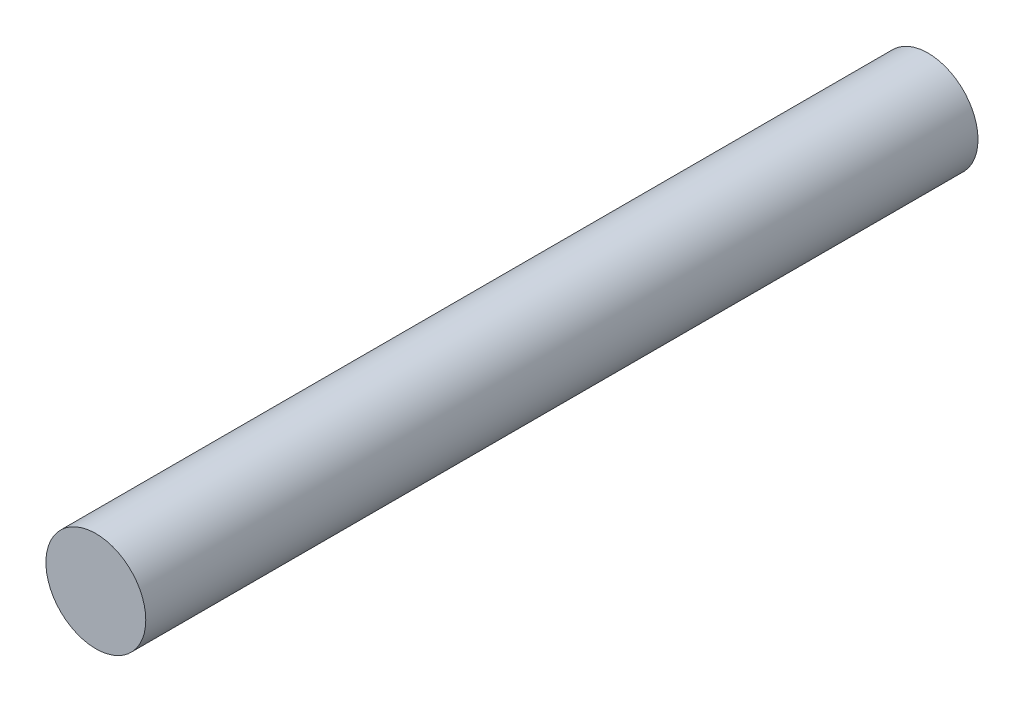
ISO-10303-21;
HEADER;
FILE_DESCRIPTION(('STEP AP214'),'2;1');
FILE_NAME('part.step','',(''),(''),'','','');
FILE_SCHEMA(('AUTOMOTIVE_DESIGN { 1 0 10303 214 1 1 1 1 }'));
ENDSEC;
DATA;
#1=APPLICATION_CONTEXT('core data for automotive mechanical design processes');
#2=APPLICATION_PROTOCOL_DEFINITION('international standard','automotive_design',2000,#1);
#3=PRODUCT_CONTEXT('',#1,'mechanical');
#4=PRODUCT('Part','Part','',(#3));
#5=PRODUCT_RELATED_PRODUCT_CATEGORY('part','',(#4));
#6=PRODUCT_DEFINITION_FORMATION('','',#4);
#7=PRODUCT_DEFINITION_CONTEXT('part definition',#1,'design');
#8=PRODUCT_DEFINITION('design','',#6,#7);
#9=PRODUCT_DEFINITION_SHAPE('','',#8);
#10=(LENGTH_UNIT() NAMED_UNIT(*) SI_UNIT(.MILLI.,.METRE.));
#11=(NAMED_UNIT(*) PLANE_ANGLE_UNIT() SI_UNIT($,.RADIAN.));
#12=(NAMED_UNIT(*) SI_UNIT($,.STERADIAN.) SOLID_ANGLE_UNIT());
#13=UNCERTAINTY_MEASURE_WITH_UNIT(LENGTH_MEASURE(1.E-05),#10,'distance_accuracy_value','');
#14=(GEOMETRIC_REPRESENTATION_CONTEXT(3) GLOBAL_UNCERTAINTY_ASSIGNED_CONTEXT((#13)) GLOBAL_UNIT_ASSIGNED_CONTEXT((#10,
#11,#12)) REPRESENTATION_CONTEXT('',''));
#15=CARTESIAN_POINT('',(0.,0.,0.));
#16=DIRECTION('',(0.,0.,1.));
#17=DIRECTION('',(1.,0.,0.));
#18=AXIS2_PLACEMENT_3D('',#15,#16,#17);
#19=CARTESIAN_POINT('',(0.,0.,-500.));
#20=DIRECTION('',(0.,0.,1.));
#21=DIRECTION('',(1.,0.,0.));
#22=AXIS2_PLACEMENT_3D('',#19,#20,#21);
#23=CYLINDRICAL_SURFACE('',#22,30.);
#24=CARTESIAN_POINT('',(0.,0.,-500.));
#25=DIRECTION('',(0.,0.,1.));
#26=DIRECTION('',(1.,0.,0.));
#27=AXIS2_PLACEMENT_3D('',#24,#25,#26);
#28=CIRCLE('',#27,30.);
#29=CARTESIAN_POINT('',(30.,0.,-500.));
#30=VERTEX_POINT('',#29);
#31=EDGE_CURVE('E10',#30,#30,#28,.T.);
#32=ORIENTED_EDGE('',*,*,#31,.T.);
#33=EDGE_LOOP('',(#32));
#34=FACE_BOUND('',#33,.T.);
#35=CARTESIAN_POINT('',(0.,0.,0.));
#36=DIRECTION('',(0.,0.,1.));
#37=DIRECTION('',(1.,0.,0.));
#38=AXIS2_PLACEMENT_3D('',#35,#36,#37);
#39=CIRCLE('',#38,30.);
#40=CARTESIAN_POINT('',(30.,0.,0.));
#41=VERTEX_POINT('',#40);
#42=EDGE_CURVE('E40',#41,#41,#39,.T.);
#43=ORIENTED_EDGE('',*,*,#42,.F.);
#44=EDGE_LOOP('',(#43));
#45=FACE_BOUND('',#44,.T.);
#46=ADVANCED_FACE('F37',(#34,#45),#23,.T.);
#47=CARTESIAN_POINT('',(0.,0.,-500.));
#48=DIRECTION('',(0.,0.,1.));
#49=DIRECTION('',(1.,0.,0.));
#50=AXIS2_PLACEMENT_3D('',#47,#48,#49);
#51=PLANE('',#50);
#52=ORIENTED_EDGE('',*,*,#31,.F.);
#53=EDGE_LOOP('',(#52));
#54=FACE_BOUND('',#53,.T.);
#55=ADVANCED_FACE('F54',(#54),#51,.F.);
#56=CARTESIAN_POINT('',(0.,0.,0.));
#57=DIRECTION('',(0.,0.,1.));
#58=DIRECTION('',(1.,0.,0.));
#59=AXIS2_PLACEMENT_3D('',#56,#57,#58);
#60=PLANE('',#59);
#61=ORIENTED_EDGE('',*,*,#42,.T.);
#62=EDGE_LOOP('',(#61));
#63=FACE_BOUND('',#62,.T.);
#64=ADVANCED_FACE('F51',(#63),#60,.T.);
#65=CLOSED_SHELL('',(#46,#55,#64));
#66=MANIFOLD_SOLID_BREP('B2',#65);
#67=ADVANCED_BREP_SHAPE_REPRESENTATION('',(#18,#66),#14);
#68=SHAPE_DEFINITION_REPRESENTATION(#9,#67);
ENDSEC;
END-ISO-10303-21;
